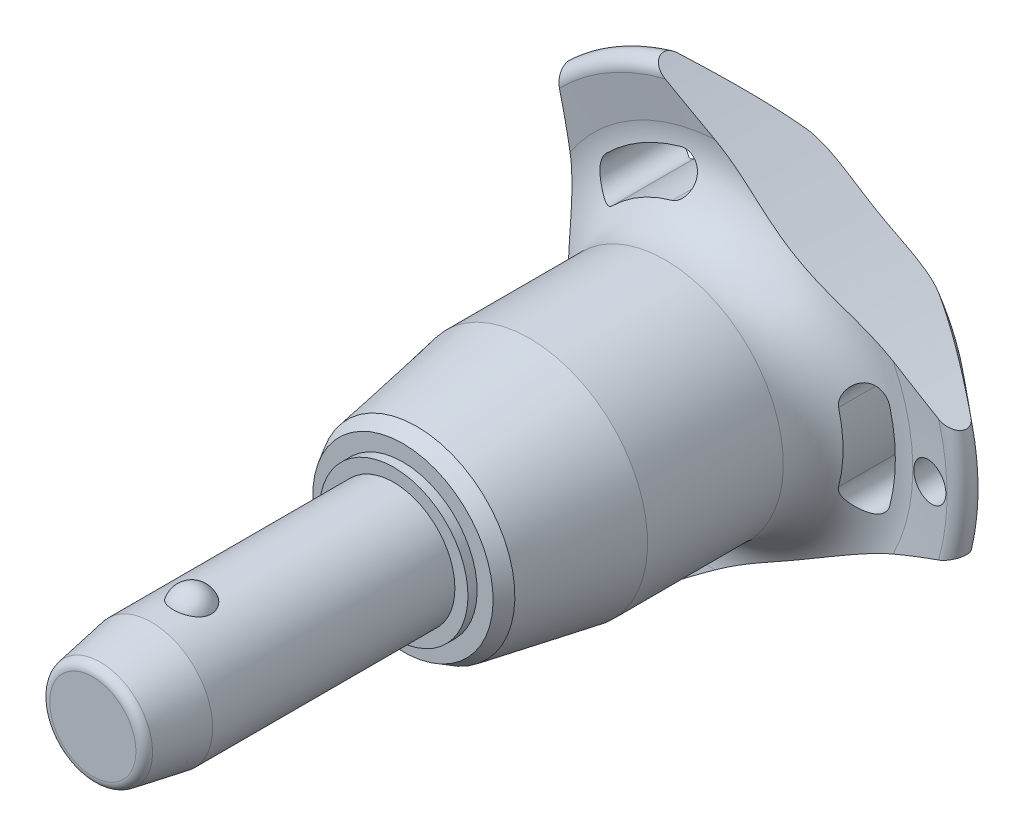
from build123d import *

# Parameters (mm, degrees)
SKETCH1_R           = 5
BOSS_EXTRUDE1_DEPTH = 15
SKETCH2_R           = 4.25
BOSS_EXTRUDE2_DEPTH = 33.3
BOSS_EXTRUDE3_START = 9.6
SKETCH1_2_R         = 5
BOSS_EXTRUDE3_DEPTH = 9.6
CHAMFER1_SIZE       = 4.8
CHAMFER1_SIZE2      = 0.846369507
FILLET1_R           = 0.75
SKETCH6_R           = 102.8
CUT_EXTRUDE1_DEPTH  = 56.691633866
CIRPATTERN1_COUNT   = 3
SKETCH7_R           = 1.5
CUT_EXTRUDE2_DEPTH  = 56.400455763


with BuildPart() as part:
    # Sketch1 → Boss-Extrude1 (new body)
    with BuildSketch(Plane.XY):
        Circle(SKETCH1_R)
    extrude(amount=-BOSS_EXTRUDE1_DEPTH)

    # Sketch2 → Boss-Extrude2 (add)
    with BuildSketch(Plane(origin=(0, 0, -15), x_dir=(-1, 0, 0), z_dir=(0, 0, -1))):
        Circle(SKETCH2_R)
    extrude(amount=BOSS_EXTRUDE2_DEPTH)

    # Sketch3 → Revolve1 (revolve)
    with BuildSketch(Plane(origin=(0, 0, 0), x_dir=(0, 0, -1), z_dir=(1, 0, 0))):
        with BuildLine():
            Line((-1.516575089, 6), (-1.516575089, 2.7))
            ThreePointArc((-1.516575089, 2.7), (0.133424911, 4.35), (-1.516575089, 6))
        make_face()
        with BuildLine():
            Line((-1.516575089, -2.7), (-1.516575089, -6))
            ThreePointArc((-1.516575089, -6), (0.133424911, -4.35), (-1.516575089, -2.7))
        make_face()
    revolve(axis=Axis((0, -2.7, 1.516575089), (0, 1, 0)))

    # Sketch1_2 → Boss-Extrude3 (add)
    with BuildSketch(Plane.XY.offset(BOSS_EXTRUDE3_START)):
        Circle(SKETCH1_2_R)
    extrude(amount=-BOSS_EXTRUDE3_DEPTH)

    # Chamfer1
    chamfer1_edges = [part.edges().sort_by_distance(p)[0] for p in [
        (-5, 0, 9.6),
    ]]
    chamfer1_side = [part.faces().sort_by_distance(p)[0] for p in [
        (-5, 0, -2.7),
    ]]
    chamfer(chamfer1_edges, length=CHAMFER1_SIZE, length2=CHAMFER1_SIZE2, reference=chamfer1_side[0])

    # Fillet1
    fillet1_edges = [part.edges().sort_by_distance(p)[0] for p in [
        (-4.153630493, 0, 9.6),
        (4.25, 0, -48.3),
    ]]
    fillet(fillet1_edges, radius=FILLET1_R)

    # Sketch4 → Revolve2 (revolve)
    with BuildSketch(Plane(origin=(0, 0, 0), x_dir=(0, 0, -1), z_dir=(1, 0, 0))):
        Polygon((15, 0), (15, 6.067402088), (15.75, 6.067402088), (15.75, 7.371950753), (16.879772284, 8.024225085), (26.1, 9.65), (37.2, 9.65), (37.2, 0), align=None)
    revolve(axis=Axis((0, 0, -37.2), (0, 0, 1)))

    # Sketch5 → Revolve3 (revolve)
    with BuildSketch(Plane(origin=(0, 0, 0), x_dir=(0, 0, -1), z_dir=(1, 0, 0)), mode=Mode.PRIVATE) as revolve3_sk:
        with BuildLine():
            Line((42.16082631, 15.274661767), (41.757834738, 18.475067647))
            ThreePointArc((41.757834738, 18.475067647), (42.349836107, 19.516443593), (43.516044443, 19.24278761))
            Line((43.516044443, 19.24278761), (47.835691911, 14.094832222))
            ThreePointArc((47.835691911, 14.094832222), (48.3, 12.689260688), (47.67067517, 11.349423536))
            ThreePointArc((47.67067517, 11.349423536), (44.033110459, 6.185112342), (42.75, 0))
            Line((42.75, 0), (37.2, 0))
            Line((37.2, 0), (37.2, 9.65))
            ThreePointArc((37.2, 9.65), (40.949887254, 11.342683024), (42.16082631, 15.274661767))
        make_face()
    revolve(revolve3_sk.sketch.rotate(Axis((0, 0, -42.75), (0, 0, 1)), 90), axis=Axis((0, 0, -42.75), (0, 0, 1)))

    # Sketch6 → Cut-Extrude1 (cut, through all)
    with BuildSketch(Plane.XY):
        with Locations((-115.2, 0)):
            Circle(SKETCH6_R)
        with BuildLine():
            ThreePointArc((13.411913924, -3.529271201), (13.868496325, 0), (13.411913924, 3.529271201))
            ThreePointArc((13.411913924, 3.529271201), (11.694200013, 4.531299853), (10.692171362, 2.813585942))
            ThreePointArc((10.692171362, 2.813585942), (11.056165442, 0), (10.692171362, -2.813585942))
            ThreePointArc((10.692171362, -2.813585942), (11.694200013, -4.531299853), (13.411913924, -3.529271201))
        make_face()
    cut_extrude1 = extrude(amount=-CUT_EXTRUDE1_DEPTH, mode=Mode.SUBTRACT)

    # CirPattern1: Cut-Extrude1 ×3 about axis
    cirpattern1_axis = Axis((0, 0, 0), (0, 0, 1))
    for i in range(1, CIRPATTERN1_COUNT):
        add(cut_extrude1.rotate(cirpattern1_axis, i * 360 / CIRPATTERN1_COUNT), mode=Mode.SUBTRACT)

    # Sketch7 → Cut-Extrude2 (cut, through all)
    with BuildSketch(Plane.XY):
        with Locations(Location((16.868496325, 0, 0), (0, 0, 225.467095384))):
            Circle(SKETCH7_R)
    extrude(amount=-CUT_EXTRUDE2_DEPTH, mode=Mode.SUBTRACT)


solid = part.part
